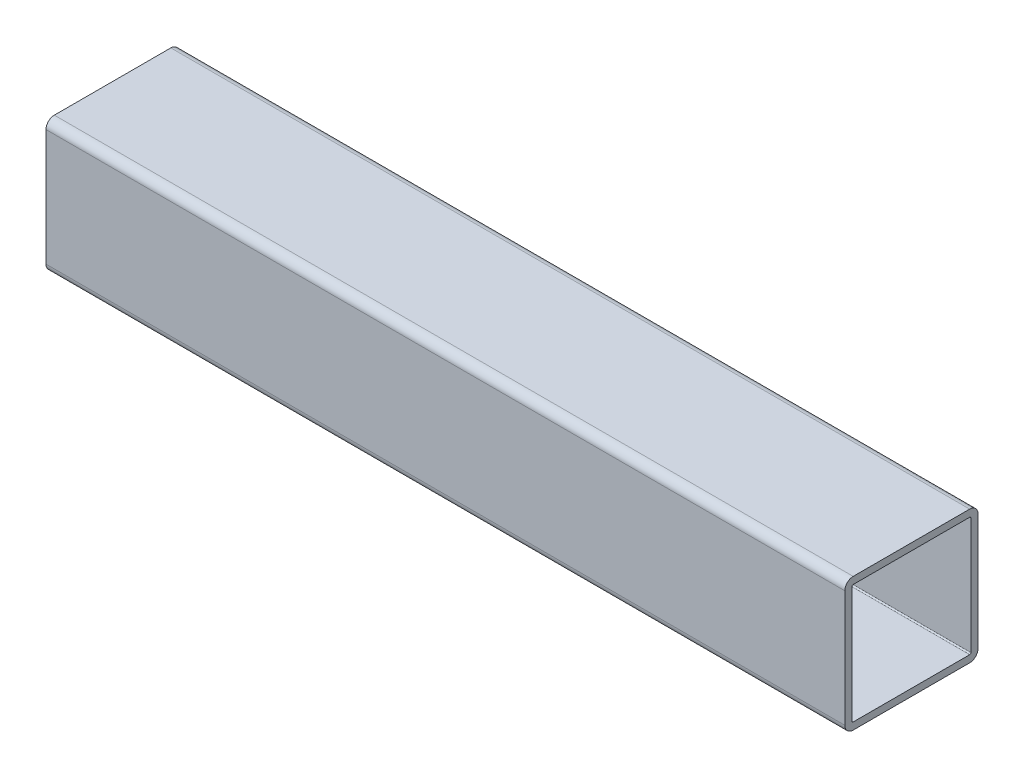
ISO-10303-21;
HEADER;
FILE_DESCRIPTION(('STEP AP214'),'2;1');
FILE_NAME('part.step','',(''),(''),'','','');
FILE_SCHEMA(('AUTOMOTIVE_DESIGN { 1 0 10303 214 1 1 1 1 }'));
ENDSEC;
DATA;
#1=APPLICATION_CONTEXT('core data for automotive mechanical design processes');
#2=APPLICATION_PROTOCOL_DEFINITION('international standard','automotive_design',2000,#1);
#3=PRODUCT_CONTEXT('',#1,'mechanical');
#4=PRODUCT('Part','Part','',(#3));
#5=PRODUCT_RELATED_PRODUCT_CATEGORY('part','',(#4));
#6=PRODUCT_DEFINITION_FORMATION('','',#4);
#7=PRODUCT_DEFINITION_CONTEXT('part definition',#1,'design');
#8=PRODUCT_DEFINITION('design','',#6,#7);
#9=PRODUCT_DEFINITION_SHAPE('','',#8);
#10=(LENGTH_UNIT() NAMED_UNIT(*) SI_UNIT(.MILLI.,.METRE.));
#11=(NAMED_UNIT(*) PLANE_ANGLE_UNIT() SI_UNIT($,.RADIAN.));
#12=(NAMED_UNIT(*) SI_UNIT($,.STERADIAN.) SOLID_ANGLE_UNIT());
#13=UNCERTAINTY_MEASURE_WITH_UNIT(LENGTH_MEASURE(1.E-05),#10,'distance_accuracy_value','');
#14=(GEOMETRIC_REPRESENTATION_CONTEXT(3) GLOBAL_UNCERTAINTY_ASSIGNED_CONTEXT((#13)) GLOBAL_UNIT_ASSIGNED_CONTEXT((#10,
#11,#12)) REPRESENTATION_CONTEXT('',''));
#15=CARTESIAN_POINT('',(0.,0.,0.));
#16=DIRECTION('',(0.,0.,1.));
#17=DIRECTION('',(1.,0.,0.));
#18=AXIS2_PLACEMENT_3D('',#15,#16,#17);
#19=CARTESIAN_POINT('',(152.4,3.65674086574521,-16.8519621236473));
#20=DIRECTION('',(-1.,0.,0.));
#21=DIRECTION('',(0.,0.,1.));
#22=AXIS2_PLACEMENT_3D('',#19,#20,#21);
#23=PLANE('',#22);
#24=CARTESIAN_POINT('',(152.4,3.65674086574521,-16.8519621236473));
#25=DIRECTION('',(1.,0.,0.));
#26=DIRECTION('',(0.,0.,1.));
#27=AXIS2_PLACEMENT_3D('',#24,#25,#26);
#28=CIRCLE('',#27,1.5875);
#29=CARTESIAN_POINT('',(152.4,3.6567408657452,-18.4394621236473));
#30=VERTEX_POINT('',#29);
#31=CARTESIAN_POINT('',(152.4,5.24424086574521,-16.8519621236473));
#32=VERTEX_POINT('',#31);
#33=EDGE_CURVE('E211',#30,#32,#28,.T.);
#34=ORIENTED_EDGE('',*,*,#33,.T.);
#35=DIRECTION('',(0.,0.,1.));
#36=VECTOR('',#35,1.);
#37=CARTESIAN_POINT('',(152.4,5.24424086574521,5.37303787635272));
#38=LINE('',#37,#36);
#39=CARTESIAN_POINT('',(152.4,5.24424086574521,5.37303787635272));
#40=VERTEX_POINT('',#39);
#41=EDGE_CURVE('E214',#32,#40,#38,.T.);
#42=ORIENTED_EDGE('',*,*,#41,.T.);
#43=CARTESIAN_POINT('',(152.4,3.65674086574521,5.37303787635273));
#44=DIRECTION('',(1.,0.,0.));
#45=DIRECTION('',(0.,0.,1.));
#46=AXIS2_PLACEMENT_3D('',#43,#44,#45);
#47=CIRCLE('',#46,1.5875);
#48=CARTESIAN_POINT('',(152.4,3.6567408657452,6.96053787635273));
#49=VERTEX_POINT('',#48);
#50=EDGE_CURVE('E217',#40,#49,#47,.T.);
#51=ORIENTED_EDGE('',*,*,#50,.T.);
#52=DIRECTION('',(0.,-1.,0.));
#53=VECTOR('',#52,1.);
#54=CARTESIAN_POINT('',(152.4,3.6567408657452,6.96053787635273));
#55=LINE('',#54,#53);
#56=CARTESIAN_POINT('',(152.4,-18.5682591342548,6.96053787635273));
#57=VERTEX_POINT('',#56);
#58=EDGE_CURVE('E219',#49,#57,#55,.T.);
#59=ORIENTED_EDGE('',*,*,#58,.T.);
#60=CARTESIAN_POINT('',(152.4,-18.5682591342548,5.37303787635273));
#61=DIRECTION('',(1.,0.,0.));
#62=DIRECTION('',(0.,0.,1.));
#63=AXIS2_PLACEMENT_3D('',#60,#61,#62);
#64=CIRCLE('',#63,1.5875);
#65=CARTESIAN_POINT('',(152.4,-20.1557591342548,5.37303787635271));
#66=VERTEX_POINT('',#65);
#67=EDGE_CURVE('E221',#57,#66,#64,.T.);
#68=ORIENTED_EDGE('',*,*,#67,.T.);
#69=DIRECTION('',(0.,0.,-1.));
#70=VECTOR('',#69,1.);
#71=CARTESIAN_POINT('',(152.4,-20.1557591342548,5.37303787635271));
#72=LINE('',#71,#70);
#73=CARTESIAN_POINT('',(152.4,-20.1557591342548,-16.8519621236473));
#74=VERTEX_POINT('',#73);
#75=EDGE_CURVE('E223',#66,#74,#72,.T.);
#76=ORIENTED_EDGE('',*,*,#75,.T.);
#77=CARTESIAN_POINT('',(152.4,-18.5682591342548,-16.8519621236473));
#78=DIRECTION('',(1.,0.,0.));
#79=DIRECTION('',(0.,0.,1.));
#80=AXIS2_PLACEMENT_3D('',#77,#78,#79);
#81=CIRCLE('',#80,1.5875);
#82=CARTESIAN_POINT('',(152.4,-18.5682591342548,-18.4394621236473));
#83=VERTEX_POINT('',#82);
#84=EDGE_CURVE('E225',#74,#83,#81,.T.);
#85=ORIENTED_EDGE('',*,*,#84,.T.);
#86=DIRECTION('',(0.,1.,0.));
#87=VECTOR('',#86,1.);
#88=CARTESIAN_POINT('',(152.4,3.6567408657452,-18.4394621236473));
#89=LINE('',#88,#87);
#90=EDGE_CURVE('E227',#83,#30,#89,.T.);
#91=ORIENTED_EDGE('',*,*,#90,.T.);
#92=EDGE_LOOP('',(#34,#42,#51,#59,#68,#76,#85,#91));
#93=FACE_BOUND('',#92,.T.);
#94=CARTESIAN_POINT('',(152.4,3.65674086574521,5.37303787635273));
#95=DIRECTION('',(1.,0.,0.));
#96=DIRECTION('',(0.,0.,1.));
#97=AXIS2_PLACEMENT_3D('',#94,#95,#96);
#98=CIRCLE('',#97,0.2413);
#99=CARTESIAN_POINT('',(152.4,3.89804086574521,5.37303787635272));
#100=VERTEX_POINT('',#99);
#101=CARTESIAN_POINT('',(152.4,3.6567408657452,5.61433787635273));
#102=VERTEX_POINT('',#101);
#103=EDGE_CURVE('E146',#100,#102,#98,.T.);
#104=ORIENTED_EDGE('',*,*,#103,.F.);
#105=DIRECTION('',(0.,0.,1.));
#106=VECTOR('',#105,1.);
#107=CARTESIAN_POINT('',(152.4,3.89804086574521,5.37303787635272));
#108=LINE('',#107,#106);
#109=CARTESIAN_POINT('',(152.4,3.89804086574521,-16.8519621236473));
#110=VERTEX_POINT('',#109);
#111=EDGE_CURVE('E179',#110,#100,#108,.T.);
#112=ORIENTED_EDGE('',*,*,#111,.F.);
#113=CARTESIAN_POINT('',(152.4,3.65674086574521,-16.8519621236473));
#114=DIRECTION('',(1.,0.,0.));
#115=DIRECTION('',(0.,0.,1.));
#116=AXIS2_PLACEMENT_3D('',#113,#114,#115);
#117=CIRCLE('',#116,0.2413);
#118=CARTESIAN_POINT('',(152.4,3.65674086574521,-17.0932621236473));
#119=VERTEX_POINT('',#118);
#120=EDGE_CURVE('E177',#119,#110,#117,.T.);
#121=ORIENTED_EDGE('',*,*,#120,.F.);
#122=DIRECTION('',(0.,1.,0.));
#123=VECTOR('',#122,1.);
#124=CARTESIAN_POINT('',(152.4,3.65674086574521,-17.0932621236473));
#125=LINE('',#124,#123);
#126=CARTESIAN_POINT('',(152.4,-18.5682591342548,-17.0932621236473));
#127=VERTEX_POINT('',#126);
#128=EDGE_CURVE('E175',#127,#119,#125,.T.);
#129=ORIENTED_EDGE('',*,*,#128,.F.);
#130=CARTESIAN_POINT('',(152.4,-18.5682591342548,-16.8519621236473));
#131=DIRECTION('',(1.,0.,0.));
#132=DIRECTION('',(0.,0.,1.));
#133=AXIS2_PLACEMENT_3D('',#130,#131,#132);
#134=CIRCLE('',#133,0.241299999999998);
#135=CARTESIAN_POINT('',(152.4,-18.8095591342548,-16.8519621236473));
#136=VERTEX_POINT('',#135);
#137=EDGE_CURVE('E173',#136,#127,#134,.T.);
#138=ORIENTED_EDGE('',*,*,#137,.F.);
#139=DIRECTION('',(0.,0.,-1.));
#140=VECTOR('',#139,1.);
#141=CARTESIAN_POINT('',(152.4,-18.8095591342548,5.37303787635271));
#142=LINE('',#141,#140);
#143=CARTESIAN_POINT('',(152.4,-18.8095591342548,5.37303787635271));
#144=VERTEX_POINT('',#143);
#145=EDGE_CURVE('E169',#144,#136,#142,.T.);
#146=ORIENTED_EDGE('',*,*,#145,.F.);
#147=CARTESIAN_POINT('',(152.4,-18.5682591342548,5.37303787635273));
#148=DIRECTION('',(1.,0.,0.));
#149=DIRECTION('',(0.,0.,1.));
#150=AXIS2_PLACEMENT_3D('',#147,#148,#149);
#151=CIRCLE('',#150,0.241299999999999);
#152=CARTESIAN_POINT('',(152.4,-18.5682591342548,5.61433787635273));
#153=VERTEX_POINT('',#152);
#154=EDGE_CURVE('E167',#153,#144,#151,.T.);
#155=ORIENTED_EDGE('',*,*,#154,.F.);
#156=DIRECTION('',(0.,-1.,0.));
#157=VECTOR('',#156,1.);
#158=CARTESIAN_POINT('',(152.4,3.6567408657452,5.61433787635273));
#159=LINE('',#158,#157);
#160=EDGE_CURVE('E154',#102,#153,#159,.T.);
#161=ORIENTED_EDGE('',*,*,#160,.F.);
#162=EDGE_LOOP('',(#104,#112,#121,#129,#138,#146,#155,#161));
#163=FACE_BOUND('',#162,.T.);
#164=ADVANCED_FACE('F33',(#93,#163),#23,.F.);
#165=CARTESIAN_POINT('',(0.,3.65674086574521,-16.8519621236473));
#166=DIRECTION('',(-1.,0.,0.));
#167=DIRECTION('',(0.,0.,1.));
#168=AXIS2_PLACEMENT_3D('',#165,#166,#167);
#169=PLANE('',#168);
#170=CARTESIAN_POINT('',(0.,3.65674086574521,-16.8519621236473));
#171=DIRECTION('',(1.,0.,0.));
#172=DIRECTION('',(0.,0.,1.));
#173=AXIS2_PLACEMENT_3D('',#170,#171,#172);
#174=CIRCLE('',#173,1.5875);
#175=CARTESIAN_POINT('',(0.,3.6567408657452,-18.4394621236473));
#176=VERTEX_POINT('',#175);
#177=CARTESIAN_POINT('',(0.,5.24424086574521,-16.8519621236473));
#178=VERTEX_POINT('',#177);
#179=EDGE_CURVE('E162',#176,#178,#174,.T.);
#180=ORIENTED_EDGE('',*,*,#179,.F.);
#181=DIRECTION('',(0.,1.,0.));
#182=VECTOR('',#181,1.);
#183=CARTESIAN_POINT('',(0.,3.6567408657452,-18.4394621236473));
#184=LINE('',#183,#182);
#185=CARTESIAN_POINT('',(0.,-18.5682591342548,-18.4394621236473));
#186=VERTEX_POINT('',#185);
#187=EDGE_CURVE('E215',#186,#176,#184,.T.);
#188=ORIENTED_EDGE('',*,*,#187,.F.);
#189=CARTESIAN_POINT('',(0.,-18.5682591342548,-16.8519621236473));
#190=DIRECTION('',(1.,0.,0.));
#191=DIRECTION('',(0.,0.,1.));
#192=AXIS2_PLACEMENT_3D('',#189,#190,#191);
#193=CIRCLE('',#192,1.5875);
#194=CARTESIAN_POINT('',(0.,-20.1557591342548,-16.8519621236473));
#195=VERTEX_POINT('',#194);
#196=EDGE_CURVE('E242',#195,#186,#193,.T.);
#197=ORIENTED_EDGE('',*,*,#196,.F.);
#198=DIRECTION('',(0.,0.,-1.));
#199=VECTOR('',#198,1.);
#200=CARTESIAN_POINT('',(0.,-20.1557591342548,5.37303787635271));
#201=LINE('',#200,#199);
#202=CARTESIAN_POINT('',(0.,-20.1557591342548,5.37303787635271));
#203=VERTEX_POINT('',#202);
#204=EDGE_CURVE('E240',#203,#195,#201,.T.);
#205=ORIENTED_EDGE('',*,*,#204,.F.);
#206=CARTESIAN_POINT('',(0.,-18.5682591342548,5.37303787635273));
#207=DIRECTION('',(1.,0.,0.));
#208=DIRECTION('',(0.,0.,1.));
#209=AXIS2_PLACEMENT_3D('',#206,#207,#208);
#210=CIRCLE('',#209,1.5875);
#211=CARTESIAN_POINT('',(0.,-18.5682591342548,6.96053787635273));
#212=VERTEX_POINT('',#211);
#213=EDGE_CURVE('E238',#212,#203,#210,.T.);
#214=ORIENTED_EDGE('',*,*,#213,.F.);
#215=DIRECTION('',(0.,-1.,0.));
#216=VECTOR('',#215,1.);
#217=CARTESIAN_POINT('',(0.,3.6567408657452,6.96053787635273));
#218=LINE('',#217,#216);
#219=CARTESIAN_POINT('',(0.,3.6567408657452,6.96053787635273));
#220=VERTEX_POINT('',#219);
#221=EDGE_CURVE('E236',#220,#212,#218,.T.);
#222=ORIENTED_EDGE('',*,*,#221,.F.);
#223=CARTESIAN_POINT('',(0.,3.65674086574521,5.37303787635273));
#224=DIRECTION('',(1.,0.,0.));
#225=DIRECTION('',(0.,0.,1.));
#226=AXIS2_PLACEMENT_3D('',#223,#224,#225);
#227=CIRCLE('',#226,1.5875);
#228=CARTESIAN_POINT('',(0.,5.24424086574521,5.37303787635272));
#229=VERTEX_POINT('',#228);
#230=EDGE_CURVE('E234',#229,#220,#227,.T.);
#231=ORIENTED_EDGE('',*,*,#230,.F.);
#232=DIRECTION('',(0.,0.,1.));
#233=VECTOR('',#232,1.);
#234=CARTESIAN_POINT('',(0.,5.24424086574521,5.37303787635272));
#235=LINE('',#234,#233);
#236=EDGE_CURVE('E232',#178,#229,#235,.T.);
#237=ORIENTED_EDGE('',*,*,#236,.F.);
#238=EDGE_LOOP('',(#180,#188,#197,#205,#214,#222,#231,#237));
#239=FACE_BOUND('',#238,.T.);
#240=DIRECTION('',(0.,0.,1.));
#241=VECTOR('',#240,1.);
#242=CARTESIAN_POINT('',(0.,3.89804086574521,5.37303787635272));
#243=LINE('',#242,#241);
#244=CARTESIAN_POINT('',(0.,3.89804086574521,-16.8519621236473));
#245=VERTEX_POINT('',#244);
#246=CARTESIAN_POINT('',(0.,3.89804086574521,5.37303787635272));
#247=VERTEX_POINT('',#246);
#248=EDGE_CURVE('E155',#245,#247,#243,.T.);
#249=ORIENTED_EDGE('',*,*,#248,.T.);
#250=CARTESIAN_POINT('',(0.,3.65674086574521,5.37303787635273));
#251=DIRECTION('',(1.,0.,0.));
#252=DIRECTION('',(0.,0.,1.));
#253=AXIS2_PLACEMENT_3D('',#250,#251,#252);
#254=CIRCLE('',#253,0.2413);
#255=CARTESIAN_POINT('',(0.,3.6567408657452,5.61433787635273));
#256=VERTEX_POINT('',#255);
#257=EDGE_CURVE('E56',#247,#256,#254,.T.);
#258=ORIENTED_EDGE('',*,*,#257,.T.);
#259=DIRECTION('',(0.,-1.,0.));
#260=VECTOR('',#259,1.);
#261=CARTESIAN_POINT('',(0.,3.6567408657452,5.61433787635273));
#262=LINE('',#261,#260);
#263=CARTESIAN_POINT('',(0.,-18.5682591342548,5.61433787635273));
#264=VERTEX_POINT('',#263);
#265=EDGE_CURVE('E161',#256,#264,#262,.T.);
#266=ORIENTED_EDGE('',*,*,#265,.T.);
#267=CARTESIAN_POINT('',(0.,-18.5682591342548,5.37303787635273));
#268=DIRECTION('',(1.,0.,0.));
#269=DIRECTION('',(0.,0.,1.));
#270=AXIS2_PLACEMENT_3D('',#267,#268,#269);
#271=CIRCLE('',#270,0.241299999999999);
#272=CARTESIAN_POINT('',(0.,-18.8095591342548,5.37303787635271));
#273=VERTEX_POINT('',#272);
#274=EDGE_CURVE('E183',#264,#273,#271,.T.);
#275=ORIENTED_EDGE('',*,*,#274,.T.);
#276=DIRECTION('',(0.,0.,-1.));
#277=VECTOR('',#276,1.);
#278=CARTESIAN_POINT('',(0.,-18.8095591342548,5.37303787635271));
#279=LINE('',#278,#277);
#280=CARTESIAN_POINT('',(0.,-18.8095591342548,-16.8519621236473));
#281=VERTEX_POINT('',#280);
#282=EDGE_CURVE('E186',#273,#281,#279,.T.);
#283=ORIENTED_EDGE('',*,*,#282,.T.);
#284=CARTESIAN_POINT('',(0.,-18.5682591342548,-16.8519621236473));
#285=DIRECTION('',(1.,0.,0.));
#286=DIRECTION('',(0.,0.,1.));
#287=AXIS2_PLACEMENT_3D('',#284,#285,#286);
#288=CIRCLE('',#287,0.241299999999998);
#289=CARTESIAN_POINT('',(0.,-18.5682591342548,-17.0932621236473));
#290=VERTEX_POINT('',#289);
#291=EDGE_CURVE('E189',#281,#290,#288,.T.);
#292=ORIENTED_EDGE('',*,*,#291,.T.);
#293=DIRECTION('',(0.,1.,0.));
#294=VECTOR('',#293,1.);
#295=CARTESIAN_POINT('',(0.,3.65674086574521,-17.0932621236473));
#296=LINE('',#295,#294);
#297=CARTESIAN_POINT('',(0.,3.65674086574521,-17.0932621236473));
#298=VERTEX_POINT('',#297);
#299=EDGE_CURVE('E192',#290,#298,#296,.T.);
#300=ORIENTED_EDGE('',*,*,#299,.T.);
#301=CARTESIAN_POINT('',(0.,3.65674086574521,-16.8519621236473));
#302=DIRECTION('',(1.,0.,0.));
#303=DIRECTION('',(0.,0.,1.));
#304=AXIS2_PLACEMENT_3D('',#301,#302,#303);
#305=CIRCLE('',#304,0.2413);
#306=EDGE_CURVE('E195',#298,#245,#305,.T.);
#307=ORIENTED_EDGE('',*,*,#306,.T.);
#308=EDGE_LOOP('',(#249,#258,#266,#275,#283,#292,#300,#307));
#309=FACE_BOUND('',#308,.T.);
#310=ADVANCED_FACE('F272',(#239,#309),#169,.T.);
#311=CARTESIAN_POINT('',(152.4,3.65674086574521,-16.8519621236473));
#312=DIRECTION('',(-1.,0.,0.));
#313=DIRECTION('',(0.,0.,1.));
#314=AXIS2_PLACEMENT_3D('',#311,#312,#313);
#315=CYLINDRICAL_SURFACE('',#314,1.5875);
#316=ORIENTED_EDGE('',*,*,#179,.T.);
#317=DIRECTION('',(-1.,0.,0.));
#318=VECTOR('',#317,1.);
#319=CARTESIAN_POINT('',(152.4,5.24424086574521,-16.8519621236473));
#320=LINE('',#319,#318);
#321=EDGE_CURVE('E11',#32,#178,#320,.T.);
#322=ORIENTED_EDGE('',*,*,#321,.F.);
#323=ORIENTED_EDGE('',*,*,#33,.F.);
#324=DIRECTION('',(-1.,0.,0.));
#325=VECTOR('',#324,1.);
#326=CARTESIAN_POINT('',(152.4,3.6567408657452,-18.4394621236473));
#327=LINE('',#326,#325);
#328=EDGE_CURVE('E229',#30,#176,#327,.T.);
#329=ORIENTED_EDGE('',*,*,#328,.T.);
#330=EDGE_LOOP('',(#316,#322,#323,#329));
#331=FACE_BOUND('',#330,.T.);
#332=ADVANCED_FACE('F35',(#331),#315,.T.);
#333=CARTESIAN_POINT('',(152.4,5.24424086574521,5.37303787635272));
#334=DIRECTION('',(0.,-1.,0.));
#335=DIRECTION('',(0.,0.,-1.));
#336=AXIS2_PLACEMENT_3D('',#333,#334,#335);
#337=PLANE('',#336);
#338=ORIENTED_EDGE('',*,*,#236,.T.);
#339=DIRECTION('',(-1.,0.,0.));
#340=VECTOR('',#339,1.);
#341=CARTESIAN_POINT('',(152.4,5.24424086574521,5.37303787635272));
#342=LINE('',#341,#340);
#343=EDGE_CURVE('E41',#40,#229,#342,.T.);
#344=ORIENTED_EDGE('',*,*,#343,.F.);
#345=ORIENTED_EDGE('',*,*,#41,.F.);
#346=ORIENTED_EDGE('',*,*,#321,.T.);
#347=EDGE_LOOP('',(#338,#344,#345,#346));
#348=FACE_BOUND('',#347,.T.);
#349=ADVANCED_FACE('F289',(#348),#337,.F.);
#350=CARTESIAN_POINT('',(152.4,3.65674086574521,5.37303787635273));
#351=DIRECTION('',(-1.,0.,0.));
#352=DIRECTION('',(0.,0.,1.));
#353=AXIS2_PLACEMENT_3D('',#350,#351,#352);
#354=CYLINDRICAL_SURFACE('',#353,1.5875);
#355=ORIENTED_EDGE('',*,*,#230,.T.);
#356=DIRECTION('',(-1.,0.,0.));
#357=VECTOR('',#356,1.);
#358=CARTESIAN_POINT('',(152.4,3.6567408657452,6.96053787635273));
#359=LINE('',#358,#357);
#360=EDGE_CURVE('E259',#49,#220,#359,.T.);
#361=ORIENTED_EDGE('',*,*,#360,.F.);
#362=ORIENTED_EDGE('',*,*,#50,.F.);
#363=ORIENTED_EDGE('',*,*,#343,.T.);
#364=EDGE_LOOP('',(#355,#361,#362,#363));
#365=FACE_BOUND('',#364,.T.);
#366=ADVANCED_FACE('F266',(#365),#354,.T.);
#367=CARTESIAN_POINT('',(152.4,3.6567408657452,6.96053787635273));
#368=DIRECTION('',(0.,0.,-1.));
#369=DIRECTION('',(0.,1.,0.));
#370=AXIS2_PLACEMENT_3D('',#367,#368,#369);
#371=PLANE('',#370);
#372=ORIENTED_EDGE('',*,*,#221,.T.);
#373=DIRECTION('',(-1.,0.,0.));
#374=VECTOR('',#373,1.);
#375=CARTESIAN_POINT('',(152.4,-18.5682591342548,6.96053787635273));
#376=LINE('',#375,#374);
#377=EDGE_CURVE('E256',#57,#212,#376,.T.);
#378=ORIENTED_EDGE('',*,*,#377,.F.);
#379=ORIENTED_EDGE('',*,*,#58,.F.);
#380=ORIENTED_EDGE('',*,*,#360,.T.);
#381=EDGE_LOOP('',(#372,#378,#379,#380));
#382=FACE_BOUND('',#381,.T.);
#383=ADVANCED_FACE('F278',(#382),#371,.F.);
#384=CARTESIAN_POINT('',(152.4,-18.5682591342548,5.37303787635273));
#385=DIRECTION('',(-1.,0.,0.));
#386=DIRECTION('',(0.,0.,1.));
#387=AXIS2_PLACEMENT_3D('',#384,#385,#386);
#388=CYLINDRICAL_SURFACE('',#387,1.5875);
#389=ORIENTED_EDGE('',*,*,#213,.T.);
#390=DIRECTION('',(-1.,0.,0.));
#391=VECTOR('',#390,1.);
#392=CARTESIAN_POINT('',(152.4,-20.1557591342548,5.37303787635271));
#393=LINE('',#392,#391);
#394=EDGE_CURVE('E253',#66,#203,#393,.T.);
#395=ORIENTED_EDGE('',*,*,#394,.F.);
#396=ORIENTED_EDGE('',*,*,#67,.F.);
#397=ORIENTED_EDGE('',*,*,#377,.T.);
#398=EDGE_LOOP('',(#389,#395,#396,#397));
#399=FACE_BOUND('',#398,.T.);
#400=ADVANCED_FACE('F282',(#399),#388,.T.);
#401=CARTESIAN_POINT('',(152.4,-20.1557591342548,5.37303787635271));
#402=DIRECTION('',(0.,1.,0.));
#403=DIRECTION('',(0.,0.,1.));
#404=AXIS2_PLACEMENT_3D('',#401,#402,#403);
#405=PLANE('',#404);
#406=ORIENTED_EDGE('',*,*,#204,.T.);
#407=DIRECTION('',(-1.,0.,0.));
#408=VECTOR('',#407,1.);
#409=CARTESIAN_POINT('',(152.4,-20.1557591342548,-16.8519621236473));
#410=LINE('',#409,#408);
#411=EDGE_CURVE('E250',#74,#195,#410,.T.);
#412=ORIENTED_EDGE('',*,*,#411,.F.);
#413=ORIENTED_EDGE('',*,*,#75,.F.);
#414=ORIENTED_EDGE('',*,*,#394,.T.);
#415=EDGE_LOOP('',(#406,#412,#413,#414));
#416=FACE_BOUND('',#415,.T.);
#417=ADVANCED_FACE('F302',(#416),#405,.F.);
#418=CARTESIAN_POINT('',(152.4,-18.5682591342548,-16.8519621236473));
#419=DIRECTION('',(-1.,0.,0.));
#420=DIRECTION('',(0.,0.,1.));
#421=AXIS2_PLACEMENT_3D('',#418,#419,#420);
#422=CYLINDRICAL_SURFACE('',#421,1.5875);
#423=ORIENTED_EDGE('',*,*,#196,.T.);
#424=DIRECTION('',(-1.,0.,0.));
#425=VECTOR('',#424,1.);
#426=CARTESIAN_POINT('',(152.4,-18.5682591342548,-18.4394621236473));
#427=LINE('',#426,#425);
#428=EDGE_CURVE('E247',#83,#186,#427,.T.);
#429=ORIENTED_EDGE('',*,*,#428,.F.);
#430=ORIENTED_EDGE('',*,*,#84,.F.);
#431=ORIENTED_EDGE('',*,*,#411,.T.);
#432=EDGE_LOOP('',(#423,#429,#430,#431));
#433=FACE_BOUND('',#432,.T.);
#434=ADVANCED_FACE('F300',(#433),#422,.T.);
#435=CARTESIAN_POINT('',(152.4,3.6567408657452,-18.4394621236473));
#436=DIRECTION('',(0.,0.,1.));
#437=DIRECTION('',(0.,-1.,0.));
#438=AXIS2_PLACEMENT_3D('',#435,#436,#437);
#439=PLANE('',#438);
#440=ORIENTED_EDGE('',*,*,#187,.T.);
#441=ORIENTED_EDGE('',*,*,#328,.F.);
#442=ORIENTED_EDGE('',*,*,#90,.F.);
#443=ORIENTED_EDGE('',*,*,#428,.T.);
#444=EDGE_LOOP('',(#440,#441,#442,#443));
#445=FACE_BOUND('',#444,.T.);
#446=ADVANCED_FACE('F295',(#445),#439,.F.);
#447=CARTESIAN_POINT('',(152.4,3.65674086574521,5.37303787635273));
#448=DIRECTION('',(-1.,0.,0.));
#449=DIRECTION('',(0.,0.,1.));
#450=AXIS2_PLACEMENT_3D('',#447,#448,#449);
#451=CYLINDRICAL_SURFACE('',#450,0.2413);
#452=ORIENTED_EDGE('',*,*,#257,.F.);
#453=DIRECTION('',(-1.,0.,0.));
#454=VECTOR('',#453,1.);
#455=CARTESIAN_POINT('',(152.4,3.89804086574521,5.37303787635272));
#456=LINE('',#455,#454);
#457=EDGE_CURVE('E150',#100,#247,#456,.T.);
#458=ORIENTED_EDGE('',*,*,#457,.F.);
#459=ORIENTED_EDGE('',*,*,#103,.T.);
#460=DIRECTION('',(-1.,0.,0.));
#461=VECTOR('',#460,1.);
#462=CARTESIAN_POINT('',(152.4,3.6567408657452,5.61433787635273));
#463=LINE('',#462,#461);
#464=EDGE_CURVE('E149',#102,#256,#463,.T.);
#465=ORIENTED_EDGE('',*,*,#464,.T.);
#466=EDGE_LOOP('',(#452,#458,#459,#465));
#467=FACE_BOUND('',#466,.T.);
#468=ADVANCED_FACE('F148',(#467),#451,.F.);
#469=CARTESIAN_POINT('',(152.4,3.6567408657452,5.61433787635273));
#470=DIRECTION('',(0.,0.,-1.));
#471=DIRECTION('',(0.,1.,0.));
#472=AXIS2_PLACEMENT_3D('',#469,#470,#471);
#473=PLANE('',#472);
#474=ORIENTED_EDGE('',*,*,#265,.F.);
#475=ORIENTED_EDGE('',*,*,#464,.F.);
#476=ORIENTED_EDGE('',*,*,#160,.T.);
#477=DIRECTION('',(-1.,0.,0.));
#478=VECTOR('',#477,1.);
#479=CARTESIAN_POINT('',(152.4,-18.5682591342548,5.61433787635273));
#480=LINE('',#479,#478);
#481=EDGE_CURVE('E163',#153,#264,#480,.T.);
#482=ORIENTED_EDGE('',*,*,#481,.T.);
#483=EDGE_LOOP('',(#474,#475,#476,#482));
#484=FACE_BOUND('',#483,.T.);
#485=ADVANCED_FACE('F158',(#484),#473,.T.);
#486=CARTESIAN_POINT('',(152.4,-18.5682591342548,5.37303787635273));
#487=DIRECTION('',(-1.,0.,0.));
#488=DIRECTION('',(0.,0.,1.));
#489=AXIS2_PLACEMENT_3D('',#486,#487,#488);
#490=CYLINDRICAL_SURFACE('',#489,0.241299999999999);
#491=ORIENTED_EDGE('',*,*,#274,.F.);
#492=ORIENTED_EDGE('',*,*,#481,.F.);
#493=ORIENTED_EDGE('',*,*,#154,.T.);
#494=DIRECTION('',(-1.,0.,0.));
#495=VECTOR('',#494,1.);
#496=CARTESIAN_POINT('',(152.4,-18.8095591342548,5.37303787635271));
#497=LINE('',#496,#495);
#498=EDGE_CURVE('E208',#144,#273,#497,.T.);
#499=ORIENTED_EDGE('',*,*,#498,.T.);
#500=EDGE_LOOP('',(#491,#492,#493,#499));
#501=FACE_BOUND('',#500,.T.);
#502=ADVANCED_FACE('F327',(#501),#490,.F.);
#503=CARTESIAN_POINT('',(152.4,-18.8095591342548,5.37303787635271));
#504=DIRECTION('',(0.,1.,0.));
#505=DIRECTION('',(0.,0.,1.));
#506=AXIS2_PLACEMENT_3D('',#503,#504,#505);
#507=PLANE('',#506);
#508=ORIENTED_EDGE('',*,*,#282,.F.);
#509=ORIENTED_EDGE('',*,*,#498,.F.);
#510=ORIENTED_EDGE('',*,*,#145,.T.);
#511=DIRECTION('',(-1.,0.,0.));
#512=VECTOR('',#511,1.);
#513=CARTESIAN_POINT('',(152.4,-18.8095591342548,-16.8519621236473));
#514=LINE('',#513,#512);
#515=EDGE_CURVE('E206',#136,#281,#514,.T.);
#516=ORIENTED_EDGE('',*,*,#515,.T.);
#517=EDGE_LOOP('',(#508,#509,#510,#516));
#518=FACE_BOUND('',#517,.T.);
#519=ADVANCED_FACE('F331',(#518),#507,.T.);
#520=CARTESIAN_POINT('',(152.4,-18.5682591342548,-16.8519621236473));
#521=DIRECTION('',(-1.,0.,0.));
#522=DIRECTION('',(0.,0.,1.));
#523=AXIS2_PLACEMENT_3D('',#520,#521,#522);
#524=CYLINDRICAL_SURFACE('',#523,0.241299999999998);
#525=ORIENTED_EDGE('',*,*,#291,.F.);
#526=ORIENTED_EDGE('',*,*,#515,.F.);
#527=ORIENTED_EDGE('',*,*,#137,.T.);
#528=DIRECTION('',(-1.,0.,0.));
#529=VECTOR('',#528,1.);
#530=CARTESIAN_POINT('',(152.4,-18.5682591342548,-17.0932621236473));
#531=LINE('',#530,#529);
#532=EDGE_CURVE('E204',#127,#290,#531,.T.);
#533=ORIENTED_EDGE('',*,*,#532,.T.);
#534=EDGE_LOOP('',(#525,#526,#527,#533));
#535=FACE_BOUND('',#534,.T.);
#536=ADVANCED_FACE('F337',(#535),#524,.F.);
#537=CARTESIAN_POINT('',(152.4,3.65674086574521,-17.0932621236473));
#538=DIRECTION('',(0.,0.,1.));
#539=DIRECTION('',(1.,0.,0.));
#540=AXIS2_PLACEMENT_3D('',#537,#538,#539);
#541=PLANE('',#540);
#542=ORIENTED_EDGE('',*,*,#299,.F.);
#543=ORIENTED_EDGE('',*,*,#532,.F.);
#544=ORIENTED_EDGE('',*,*,#128,.T.);
#545=DIRECTION('',(-1.,0.,0.));
#546=VECTOR('',#545,1.);
#547=CARTESIAN_POINT('',(152.4,3.65674086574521,-17.0932621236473));
#548=LINE('',#547,#546);
#549=EDGE_CURVE('E202',#119,#298,#548,.T.);
#550=ORIENTED_EDGE('',*,*,#549,.T.);
#551=EDGE_LOOP('',(#542,#543,#544,#550));
#552=FACE_BOUND('',#551,.T.);
#553=ADVANCED_FACE('F341',(#552),#541,.T.);
#554=CARTESIAN_POINT('',(152.4,3.65674086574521,-16.8519621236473));
#555=DIRECTION('',(-1.,0.,0.));
#556=DIRECTION('',(0.,0.,1.));
#557=AXIS2_PLACEMENT_3D('',#554,#555,#556);
#558=CYLINDRICAL_SURFACE('',#557,0.2413);
#559=ORIENTED_EDGE('',*,*,#306,.F.);
#560=ORIENTED_EDGE('',*,*,#549,.F.);
#561=ORIENTED_EDGE('',*,*,#120,.T.);
#562=DIRECTION('',(-1.,0.,0.));
#563=VECTOR('',#562,1.);
#564=CARTESIAN_POINT('',(152.4,3.89804086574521,-16.8519621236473));
#565=LINE('',#564,#563);
#566=EDGE_CURVE('E48',#110,#245,#565,.T.);
#567=ORIENTED_EDGE('',*,*,#566,.T.);
#568=EDGE_LOOP('',(#559,#560,#561,#567));
#569=FACE_BOUND('',#568,.T.);
#570=ADVANCED_FACE('F345',(#569),#558,.F.);
#571=CARTESIAN_POINT('',(152.4,3.89804086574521,5.37303787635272));
#572=DIRECTION('',(0.,-1.,0.));
#573=DIRECTION('',(0.,0.,-1.));
#574=AXIS2_PLACEMENT_3D('',#571,#572,#573);
#575=PLANE('',#574);
#576=ORIENTED_EDGE('',*,*,#248,.F.);
#577=ORIENTED_EDGE('',*,*,#566,.F.);
#578=ORIENTED_EDGE('',*,*,#111,.T.);
#579=ORIENTED_EDGE('',*,*,#457,.T.);
#580=EDGE_LOOP('',(#576,#577,#578,#579));
#581=FACE_BOUND('',#580,.T.);
#582=ADVANCED_FACE('F349',(#581),#575,.T.);
#583=CLOSED_SHELL('',(#164,#310,#332,#349,#366,#383,#400,#417,#434,#446,#468,#485,#502,#519,
#536,#553,#570,#582));
#584=MANIFOLD_SOLID_BREP('B2',#583);
#585=ADVANCED_BREP_SHAPE_REPRESENTATION('',(#18,#584),#14);
#586=SHAPE_DEFINITION_REPRESENTATION(#9,#585);
ENDSEC;
END-ISO-10303-21;
